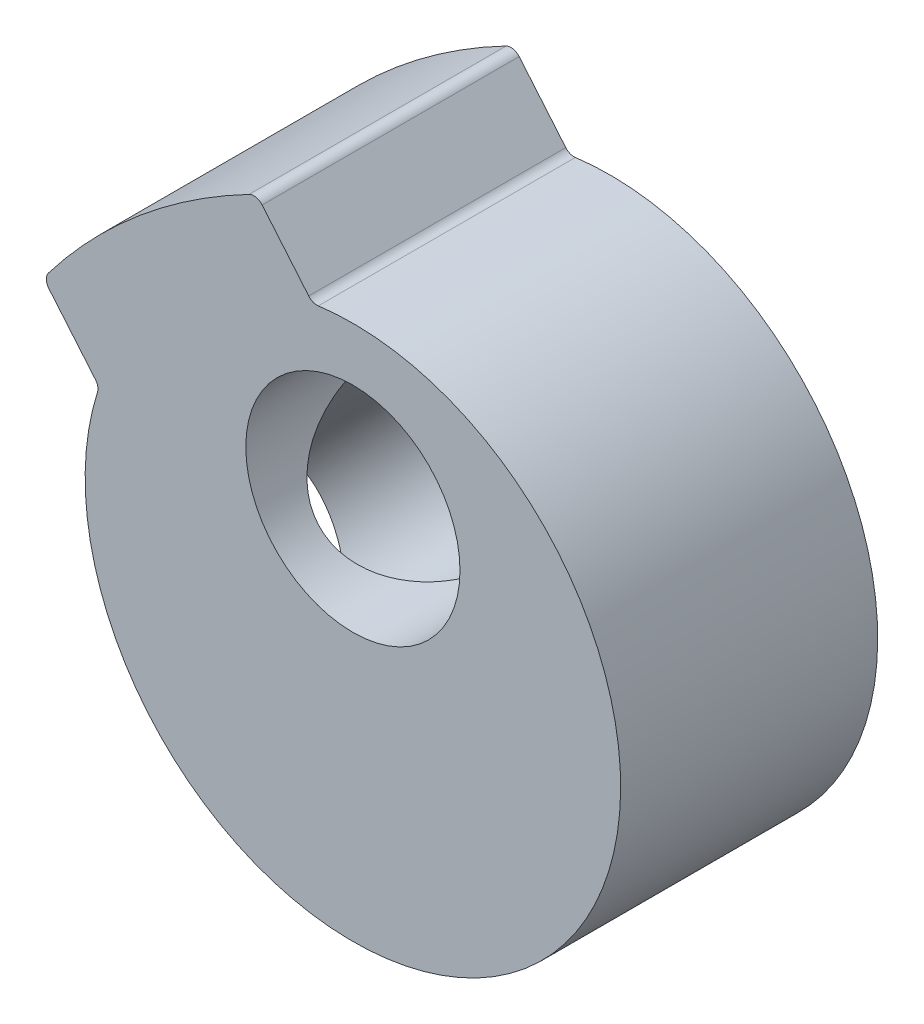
from build123d import *

# Parameters (mm, degrees)
ESQUISSE1_R             = 5
EXTRUSION1_DEPTH        = 6
ESQUISSE7_R             = 4
ENL_V_MAT_EXTRU_1_DEPTH = 24.389945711


with BuildPart() as part:
    # Esquisse1 → Extrusion1 (new, symmetric)
    with BuildSketch(Plane.XY):
        with BuildLine():
            Line((-14.195239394, 1.80502267), (-12.02067435, -0.786523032))
            ThreePointArc((-12.02067435, -0.786523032), (-11.913371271, -1.010033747), (-11.926631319, -1.257612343))
            ThreePointArc((-11.926631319, -1.257612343), (8.034845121, -14.575555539), (-1.614494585, 7.395297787))
            ThreePointArc((-1.614494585, 7.395297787), (-1.86061449, 7.425230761), (-2.06209659, 7.569715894))
            Line((-2.06209659, 7.569715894), (-4.236661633, 10.161261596))
            ThreePointArc((-4.236661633, 10.161261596), (-4.521701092, 10.330173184), (-4.8497662, 10.283784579))
            ThreePointArc((-4.8497662, 10.283784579), (-9.96320795, 6.873688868), (-14.209436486, 2.430088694))
            ThreePointArc((-14.209436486, 2.430088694), (-14.312088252, 2.115062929), (-14.195239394, 1.80502267))
        make_face()
        Circle(ESQUISSE1_R, mode=Mode.SUBTRACT)
    extrude(amount=EXTRUSION1_DEPTH, both=True)

    # Esquisse7 → Enl_v. mat.-Extru.1 (cut, through all)
    with BuildSketch(Plane(origin=(0, 0, 0), x_dir=(0, 0, -1), z_dir=(0.7071067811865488, 0.7071067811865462, 0))):
        with Locations(Location((0, 0, 0), (0, 0, 90))):
            Circle(ESQUISSE7_R)
    extrude(amount=-ENL_V_MAT_EXTRU_1_DEPTH, mode=Mode.SUBTRACT)


solid = part.part
